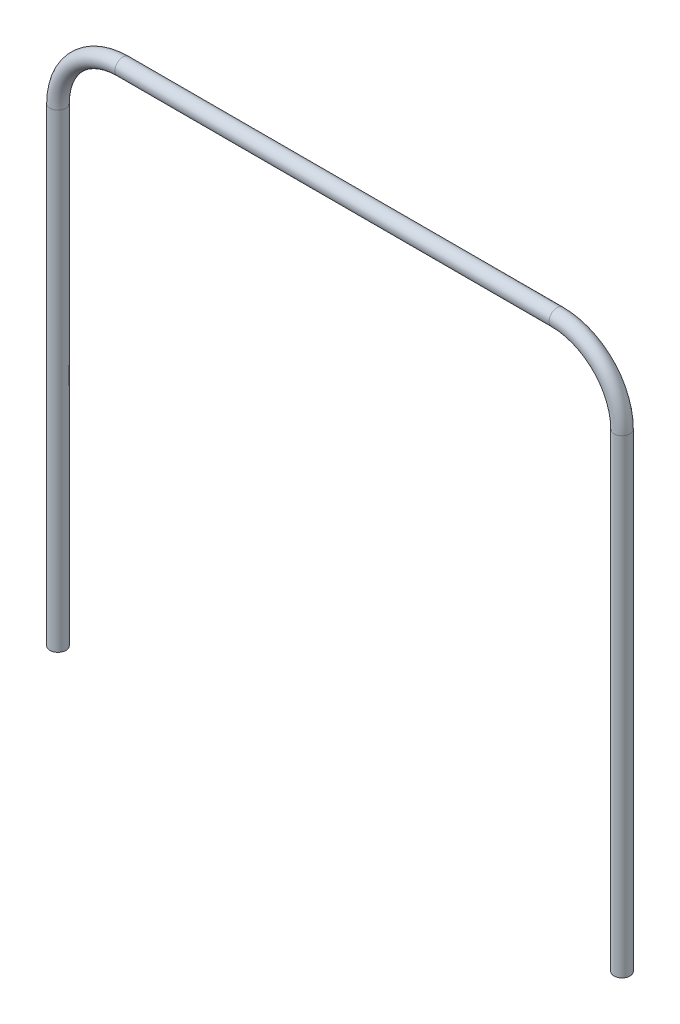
from build123d import *

# Parameters (mm, degrees)
ESQUISSE2_R   = 8
ESQUISSE2_R_2 = 7


with BuildPart() as part:
    # Base-Balayage: sweep along a path in Esquisse1
    with BuildLine(Plane.XY) as base_balayage_path:
        Line((0, 0), (0, 470))
        ThreePointArc((0, 470), (19.038059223, 515.961940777), (65, 535))
        Line((65, 535), (499.55, 535))
        ThreePointArc((499.55, 535), (545.511940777, 515.961940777), (564.55, 470))
        Line((564.55, 470), (564.55, 0))
    # Esquisse2 → Base-Balayage (sweep)
    with BuildSketch(Plane(origin=(0, 0, 0), x_dir=(1, 0, 0), z_dir=(0, 1, 0))):
        Circle(ESQUISSE2_R)
        Circle(ESQUISSE2_R_2, mode=Mode.SUBTRACT)
    sweep(path=base_balayage_path.line)


solid = part.part
